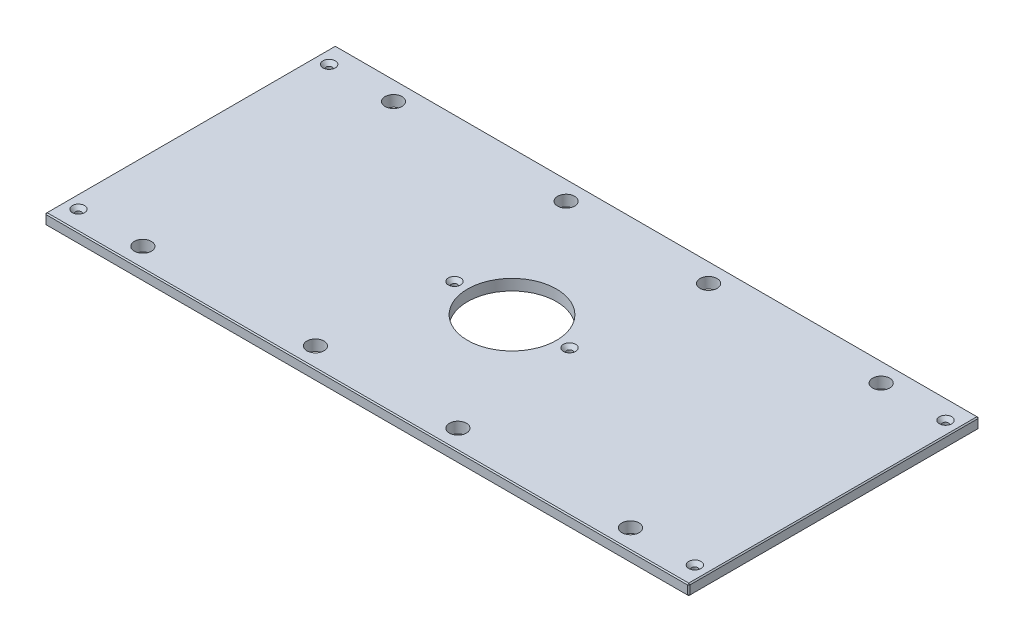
ISO-10303-21;
HEADER;
FILE_DESCRIPTION(('STEP AP214'),'2;1');
FILE_NAME('part.step','',(''),(''),'','','');
FILE_SCHEMA(('AUTOMOTIVE_DESIGN { 1 0 10303 214 1 1 1 1 }'));
ENDSEC;
DATA;
#1=APPLICATION_CONTEXT('core data for automotive mechanical design processes');
#2=APPLICATION_PROTOCOL_DEFINITION('international standard','automotive_design',2000,#1);
#3=PRODUCT_CONTEXT('',#1,'mechanical');
#4=PRODUCT('Part','Part','',(#3));
#5=PRODUCT_RELATED_PRODUCT_CATEGORY('part','',(#4));
#6=PRODUCT_DEFINITION_FORMATION('','',#4);
#7=PRODUCT_DEFINITION_CONTEXT('part definition',#1,'design');
#8=PRODUCT_DEFINITION('design','',#6,#7);
#9=PRODUCT_DEFINITION_SHAPE('','',#8);
#10=(LENGTH_UNIT() NAMED_UNIT(*) SI_UNIT(.MILLI.,.METRE.));
#11=(NAMED_UNIT(*) PLANE_ANGLE_UNIT() SI_UNIT($,.RADIAN.));
#12=(NAMED_UNIT(*) SI_UNIT($,.STERADIAN.) SOLID_ANGLE_UNIT());
#13=UNCERTAINTY_MEASURE_WITH_UNIT(LENGTH_MEASURE(1.E-05),#10,'distance_accuracy_value','');
#14=(GEOMETRIC_REPRESENTATION_CONTEXT(3) GLOBAL_UNCERTAINTY_ASSIGNED_CONTEXT((#13)) GLOBAL_UNIT_ASSIGNED_CONTEXT((#10,
#11,#12)) REPRESENTATION_CONTEXT('',''));
#15=CARTESIAN_POINT('',(0.,0.,0.));
#16=DIRECTION('',(0.,0.,1.));
#17=DIRECTION('',(1.,0.,0.));
#18=AXIS2_PLACEMENT_3D('',#15,#16,#17);
#19=CARTESIAN_POINT('',(-373.0625,12.7,-168.275));
#20=DIRECTION('',(1.,0.,0.));
#21=DIRECTION('',(0.,0.,-1.));
#22=AXIS2_PLACEMENT_3D('',#19,#20,#21);
#23=PLANE('',#22);
#24=DIRECTION('',(0.,0.,-1.));
#25=VECTOR('',#24,1.);
#26=CARTESIAN_POINT('',(-373.0625,11.43,-168.275));
#27=LINE('',#26,#25);
#28=CARTESIAN_POINT('',(-373.0625,11.43,167.005));
#29=VERTEX_POINT('',#28);
#30=CARTESIAN_POINT('',(-373.0625,11.43,-167.005));
#31=VERTEX_POINT('',#30);
#32=EDGE_CURVE('E135',#29,#31,#27,.T.);
#33=ORIENTED_EDGE('',*,*,#32,.T.);
#34=DIRECTION('',(0.,-1.,0.));
#35=VECTOR('',#34,1.);
#36=CARTESIAN_POINT('',(-373.0625,12.7,-167.005));
#37=LINE('',#36,#35);
#38=CARTESIAN_POINT('',(-373.0625,1.26999999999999,-167.005));
#39=VERTEX_POINT('',#38);
#40=EDGE_CURVE('E131',#31,#39,#37,.T.);
#41=ORIENTED_EDGE('',*,*,#40,.T.);
#42=DIRECTION('',(0.,0.,1.));
#43=VECTOR('',#42,1.);
#44=CARTESIAN_POINT('',(-373.0625,1.26999999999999,-168.275));
#45=LINE('',#44,#43);
#46=CARTESIAN_POINT('',(-373.0625,1.26999999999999,167.005));
#47=VERTEX_POINT('',#46);
#48=EDGE_CURVE('E126',#39,#47,#45,.T.);
#49=ORIENTED_EDGE('',*,*,#48,.T.);
#50=DIRECTION('',(0.,1.,0.));
#51=VECTOR('',#50,1.);
#52=CARTESIAN_POINT('',(-373.0625,12.7,167.005));
#53=LINE('',#52,#51);
#54=EDGE_CURVE('E128',#47,#29,#53,.T.);
#55=ORIENTED_EDGE('',*,*,#54,.T.);
#56=EDGE_LOOP('',(#33,#41,#49,#55));
#57=FACE_BOUND('',#56,.T.);
#58=ADVANCED_FACE('F35',(#57),#23,.F.);
#59=CARTESIAN_POINT('',(-373.0625,12.7,168.275));
#60=DIRECTION('',(0.,0.,-1.));
#61=DIRECTION('',(-1.,0.,0.));
#62=AXIS2_PLACEMENT_3D('',#59,#60,#61);
#63=PLANE('',#62);
#64=DIRECTION('',(1.,0.,0.));
#65=VECTOR('',#64,1.);
#66=CARTESIAN_POINT('',(-373.0625,1.26999999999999,168.275));
#67=LINE('',#66,#65);
#68=CARTESIAN_POINT('',(-371.7925,1.26999999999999,168.275));
#69=VERTEX_POINT('',#68);
#70=CARTESIAN_POINT('',(371.7925,1.26999999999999,168.275));
#71=VERTEX_POINT('',#70);
#72=EDGE_CURVE('E58',#69,#71,#67,.T.);
#73=ORIENTED_EDGE('',*,*,#72,.T.);
#74=DIRECTION('',(0.,1.,0.));
#75=VECTOR('',#74,1.);
#76=CARTESIAN_POINT('',(371.7925,12.7,168.275));
#77=LINE('',#76,#75);
#78=CARTESIAN_POINT('',(371.7925,11.43,168.275));
#79=VERTEX_POINT('',#78);
#80=EDGE_CURVE('E11',#71,#79,#77,.T.);
#81=ORIENTED_EDGE('',*,*,#80,.T.);
#82=DIRECTION('',(-1.,0.,0.));
#83=VECTOR('',#82,1.);
#84=CARTESIAN_POINT('',(-373.0625,11.43,168.275));
#85=LINE('',#84,#83);
#86=CARTESIAN_POINT('',(-371.7925,11.43,168.275));
#87=VERTEX_POINT('',#86);
#88=EDGE_CURVE('E44',#79,#87,#85,.T.);
#89=ORIENTED_EDGE('',*,*,#88,.T.);
#90=DIRECTION('',(0.,-1.,0.));
#91=VECTOR('',#90,1.);
#92=CARTESIAN_POINT('',(-371.7925,12.7,168.275));
#93=LINE('',#92,#91);
#94=EDGE_CURVE('E303',#87,#69,#93,.T.);
#95=ORIENTED_EDGE('',*,*,#94,.T.);
#96=EDGE_LOOP('',(#73,#81,#89,#95));
#97=FACE_BOUND('',#96,.T.);
#98=ADVANCED_FACE('F372',(#97),#63,.F.);
#99=CARTESIAN_POINT('',(373.0625,12.7,-168.275));
#100=DIRECTION('',(-1.,0.,0.));
#101=DIRECTION('',(0.,0.,1.));
#102=AXIS2_PLACEMENT_3D('',#99,#100,#101);
#103=PLANE('',#102);
#104=DIRECTION('',(0.,0.,-1.));
#105=VECTOR('',#104,1.);
#106=CARTESIAN_POINT('',(373.0625,1.26999999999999,-168.275));
#107=LINE('',#106,#105);
#108=CARTESIAN_POINT('',(373.0625,1.26999999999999,167.005));
#109=VERTEX_POINT('',#108);
#110=CARTESIAN_POINT('',(373.0625,1.26999999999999,-167.005));
#111=VERTEX_POINT('',#110);
#112=EDGE_CURVE('E298',#109,#111,#107,.T.);
#113=ORIENTED_EDGE('',*,*,#112,.T.);
#114=DIRECTION('',(0.,1.,0.));
#115=VECTOR('',#114,1.);
#116=CARTESIAN_POINT('',(373.0625,12.7,-167.005));
#117=LINE('',#116,#115);
#118=CARTESIAN_POINT('',(373.0625,11.43,-167.005));
#119=VERTEX_POINT('',#118);
#120=EDGE_CURVE('E300',#111,#119,#117,.T.);
#121=ORIENTED_EDGE('',*,*,#120,.T.);
#122=DIRECTION('',(0.,0.,1.));
#123=VECTOR('',#122,1.);
#124=CARTESIAN_POINT('',(373.0625,11.43,168.275));
#125=LINE('',#124,#123);
#126=CARTESIAN_POINT('',(373.0625,11.43,167.005));
#127=VERTEX_POINT('',#126);
#128=EDGE_CURVE('E296',#119,#127,#125,.T.);
#129=ORIENTED_EDGE('',*,*,#128,.T.);
#130=DIRECTION('',(0.,-1.,0.));
#131=VECTOR('',#130,1.);
#132=CARTESIAN_POINT('',(373.0625,12.7,167.005));
#133=LINE('',#132,#131);
#134=EDGE_CURVE('E294',#127,#109,#133,.T.);
#135=ORIENTED_EDGE('',*,*,#134,.T.);
#136=EDGE_LOOP('',(#113,#121,#129,#135));
#137=FACE_BOUND('',#136,.T.);
#138=ADVANCED_FACE('F359',(#137),#103,.F.);
#139=CARTESIAN_POINT('',(-373.0625,12.7,-168.275));
#140=DIRECTION('',(0.,0.,1.));
#141=DIRECTION('',(1.,0.,0.));
#142=AXIS2_PLACEMENT_3D('',#139,#140,#141);
#143=PLANE('',#142);
#144=DIRECTION('',(-1.,0.,0.));
#145=VECTOR('',#144,1.);
#146=CARTESIAN_POINT('',(-373.0625,1.26999999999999,-168.275));
#147=LINE('',#146,#145);
#148=CARTESIAN_POINT('',(371.7925,1.26999999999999,-168.275));
#149=VERTEX_POINT('',#148);
#150=CARTESIAN_POINT('',(-371.7925,1.26999999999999,-168.275));
#151=VERTEX_POINT('',#150);
#152=EDGE_CURVE('E270',#149,#151,#147,.T.);
#153=ORIENTED_EDGE('',*,*,#152,.T.);
#154=DIRECTION('',(0.,1.,0.));
#155=VECTOR('',#154,1.);
#156=CARTESIAN_POINT('',(-371.7925,12.7,-168.275));
#157=LINE('',#156,#155);
#158=CARTESIAN_POINT('',(-371.7925,11.43,-168.275));
#159=VERTEX_POINT('',#158);
#160=EDGE_CURVE('E274',#151,#159,#157,.T.);
#161=ORIENTED_EDGE('',*,*,#160,.T.);
#162=DIRECTION('',(1.,0.,0.));
#163=VECTOR('',#162,1.);
#164=CARTESIAN_POINT('',(373.0625,11.43,-168.275));
#165=LINE('',#164,#163);
#166=CARTESIAN_POINT('',(371.7925,11.43,-168.275));
#167=VERTEX_POINT('',#166);
#168=EDGE_CURVE('E272',#159,#167,#165,.T.);
#169=ORIENTED_EDGE('',*,*,#168,.T.);
#170=DIRECTION('',(0.,-1.,0.));
#171=VECTOR('',#170,1.);
#172=CARTESIAN_POINT('',(371.7925,12.7,-168.275));
#173=LINE('',#172,#171);
#174=EDGE_CURVE('E268',#167,#149,#173,.T.);
#175=ORIENTED_EDGE('',*,*,#174,.T.);
#176=EDGE_LOOP('',(#153,#161,#169,#175));
#177=FACE_BOUND('',#176,.T.);
#178=ADVANCED_FACE('F333',(#177),#143,.F.);
#179=CARTESIAN_POINT('',(0.,12.7,0.));
#180=DIRECTION('',(0.,1.,0.));
#181=DIRECTION('',(0.,0.,1.));
#182=AXIS2_PLACEMENT_3D('',#179,#180,#181);
#183=PLANE('',#182);
#184=CARTESIAN_POINT('',(357.1875,12.7,-145.25498));
#185=DIRECTION('',(0.,1.,0.));
#186=DIRECTION('',(0.,0.,1.));
#187=AXIS2_PLACEMENT_3D('',#184,#185,#186);
#188=CIRCLE('',#187,7.13740000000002);
#189=CARTESIAN_POINT('',(357.1875,12.7,-138.11758));
#190=VERTEX_POINT('',#189);
#191=EDGE_CURVE('E816',#190,#190,#188,.T.);
#192=ORIENTED_EDGE('',*,*,#191,.F.);
#193=EDGE_LOOP('',(#192));
#194=FACE_BOUND('',#193,.T.);
#195=CARTESIAN_POINT('',(357.1875,12.7,145.25498));
#196=DIRECTION('',(0.,1.,0.));
#197=DIRECTION('',(0.,0.,1.));
#198=AXIS2_PLACEMENT_3D('',#195,#196,#197);
#199=CIRCLE('',#198,7.13740000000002);
#200=CARTESIAN_POINT('',(357.1875,12.7,152.39238));
#201=VERTEX_POINT('',#200);
#202=EDGE_CURVE('E820',#201,#201,#199,.T.);
#203=ORIENTED_EDGE('',*,*,#202,.F.);
#204=EDGE_LOOP('',(#203));
#205=FACE_BOUND('',#204,.T.);
#206=CARTESIAN_POINT('',(-357.1875,12.7,145.25498));
#207=DIRECTION('',(0.,1.,0.));
#208=DIRECTION('',(0.,0.,1.));
#209=AXIS2_PLACEMENT_3D('',#206,#207,#208);
#210=CIRCLE('',#209,7.13740000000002);
#211=CARTESIAN_POINT('',(-357.1875,12.7,152.39238));
#212=VERTEX_POINT('',#211);
#213=EDGE_CURVE('E824',#212,#212,#210,.T.);
#214=ORIENTED_EDGE('',*,*,#213,.F.);
#215=EDGE_LOOP('',(#214));
#216=FACE_BOUND('',#215,.T.);
#217=CARTESIAN_POINT('',(-66.675,12.7,0.));
#218=DIRECTION('',(0.,1.,0.));
#219=DIRECTION('',(0.,0.,1.));
#220=AXIS2_PLACEMENT_3D('',#217,#218,#219);
#221=CIRCLE('',#220,7.1374);
#222=CARTESIAN_POINT('',(-66.675,12.7,7.1374));
#223=VERTEX_POINT('',#222);
#224=EDGE_CURVE('E828',#223,#223,#221,.T.);
#225=ORIENTED_EDGE('',*,*,#224,.F.);
#226=EDGE_LOOP('',(#225));
#227=FACE_BOUND('',#226,.T.);
#228=CARTESIAN_POINT('',(66.675,12.7,0.));
#229=DIRECTION('',(0.,1.,0.));
#230=DIRECTION('',(0.,0.,1.));
#231=AXIS2_PLACEMENT_3D('',#228,#229,#230);
#232=CIRCLE('',#231,7.1374);
#233=CARTESIAN_POINT('',(66.675,12.7,7.1374));
#234=VERTEX_POINT('',#233);
#235=EDGE_CURVE('E832',#234,#234,#232,.T.);
#236=ORIENTED_EDGE('',*,*,#235,.F.);
#237=EDGE_LOOP('',(#236));
#238=FACE_BOUND('',#237,.T.);
#239=CARTESIAN_POINT('',(-357.1875,12.7,-145.25498));
#240=DIRECTION('',(0.,1.,0.));
#241=DIRECTION('',(0.,0.,1.));
#242=AXIS2_PLACEMENT_3D('',#239,#240,#241);
#243=CIRCLE('',#242,7.13740000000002);
#244=CARTESIAN_POINT('',(-357.1875,12.7,-138.11758));
#245=VERTEX_POINT('',#244);
#246=EDGE_CURVE('E835',#245,#245,#243,.T.);
#247=ORIENTED_EDGE('',*,*,#246,.F.);
#248=EDGE_LOOP('',(#247));
#249=FACE_BOUND('',#248,.T.);
#250=DIRECTION('',(0.,0.,-1.));
#251=VECTOR('',#250,1.);
#252=CARTESIAN_POINT('',(371.7925,12.7,-168.275));
#253=LINE('',#252,#251);
#254=CARTESIAN_POINT('',(371.7925,12.7,167.005));
#255=VERTEX_POINT('',#254);
#256=CARTESIAN_POINT('',(371.7925,12.7,-167.005));
#257=VERTEX_POINT('',#256);
#258=EDGE_CURVE('E281',#255,#257,#253,.T.);
#259=ORIENTED_EDGE('',*,*,#258,.T.);
#260=DIRECTION('',(-1.,0.,0.));
#261=VECTOR('',#260,1.);
#262=CARTESIAN_POINT('',(-373.0625,12.7,-167.005));
#263=LINE('',#262,#261);
#264=CARTESIAN_POINT('',(-371.7925,12.7,-167.005));
#265=VERTEX_POINT('',#264);
#266=EDGE_CURVE('E283',#257,#265,#263,.T.);
#267=ORIENTED_EDGE('',*,*,#266,.T.);
#268=DIRECTION('',(0.,0.,1.));
#269=VECTOR('',#268,1.);
#270=CARTESIAN_POINT('',(-371.7925,12.7,168.275));
#271=LINE('',#270,#269);
#272=CARTESIAN_POINT('',(-371.7925,12.7,167.005));
#273=VERTEX_POINT('',#272);
#274=EDGE_CURVE('E279',#265,#273,#271,.T.);
#275=ORIENTED_EDGE('',*,*,#274,.T.);
#276=DIRECTION('',(1.,0.,0.));
#277=VECTOR('',#276,1.);
#278=CARTESIAN_POINT('',(373.0625,12.7,167.005));
#279=LINE('',#278,#277);
#280=EDGE_CURVE('E277',#273,#255,#279,.T.);
#281=ORIENTED_EDGE('',*,*,#280,.T.);
#282=EDGE_LOOP('',(#259,#267,#275,#281));
#283=FACE_BOUND('',#282,.T.);
#284=CARTESIAN_POINT('',(282.575,12.7,-145.25498));
#285=DIRECTION('',(0.,1.,0.));
#286=DIRECTION('',(0.,0.,1.));
#287=AXIS2_PLACEMENT_3D('',#284,#285,#286);
#288=CIRCLE('',#287,9.92187500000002);
#289=CARTESIAN_POINT('',(282.575,12.7,-135.333105));
#290=VERTEX_POINT('',#289);
#291=EDGE_CURVE('E204',#290,#290,#288,.T.);
#292=ORIENTED_EDGE('',*,*,#291,.F.);
#293=EDGE_LOOP('',(#292));
#294=FACE_BOUND('',#293,.T.);
#295=CARTESIAN_POINT('',(-282.575,12.7,-145.25498));
#296=DIRECTION('',(0.,1.,0.));
#297=DIRECTION('',(0.,0.,1.));
#298=AXIS2_PLACEMENT_3D('',#295,#296,#297);
#299=CIRCLE('',#298,9.92187500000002);
#300=CARTESIAN_POINT('',(-282.575,12.7,-135.333105));
#301=VERTEX_POINT('',#300);
#302=EDGE_CURVE('E214',#301,#301,#299,.T.);
#303=ORIENTED_EDGE('',*,*,#302,.F.);
#304=EDGE_LOOP('',(#303));
#305=FACE_BOUND('',#304,.T.);
#306=CARTESIAN_POINT('',(282.575,12.7,145.25498));
#307=DIRECTION('',(0.,1.,0.));
#308=DIRECTION('',(0.,0.,1.));
#309=AXIS2_PLACEMENT_3D('',#306,#307,#308);
#310=CIRCLE('',#309,9.92187500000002);
#311=CARTESIAN_POINT('',(282.575,12.7,155.176855));
#312=VERTEX_POINT('',#311);
#313=EDGE_CURVE('E225',#312,#312,#310,.T.);
#314=ORIENTED_EDGE('',*,*,#313,.F.);
#315=EDGE_LOOP('',(#314));
#316=FACE_BOUND('',#315,.T.);
#317=CARTESIAN_POINT('',(-282.575,12.7,145.25498));
#318=DIRECTION('',(0.,1.,0.));
#319=DIRECTION('',(0.,0.,1.));
#320=AXIS2_PLACEMENT_3D('',#317,#318,#319);
#321=CIRCLE('',#320,9.92187500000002);
#322=CARTESIAN_POINT('',(-282.575,12.7,155.176855));
#323=VERTEX_POINT('',#322);
#324=EDGE_CURVE('E231',#323,#323,#321,.T.);
#325=ORIENTED_EDGE('',*,*,#324,.F.);
#326=EDGE_LOOP('',(#325));
#327=FACE_BOUND('',#326,.T.);
#328=CARTESIAN_POINT('',(-82.55,12.7,-145.25498));
#329=DIRECTION('',(0.,1.,0.));
#330=DIRECTION('',(0.,0.,1.));
#331=AXIS2_PLACEMENT_3D('',#328,#329,#330);
#332=CIRCLE('',#331,9.921875);
#333=CARTESIAN_POINT('',(-82.55,12.7,-135.333105));
#334=VERTEX_POINT('',#333);
#335=EDGE_CURVE('E237',#334,#334,#332,.T.);
#336=ORIENTED_EDGE('',*,*,#335,.F.);
#337=EDGE_LOOP('',(#336));
#338=FACE_BOUND('',#337,.T.);
#339=CARTESIAN_POINT('',(82.55,12.7,-145.25498));
#340=DIRECTION('',(0.,1.,0.));
#341=DIRECTION('',(0.,0.,1.));
#342=AXIS2_PLACEMENT_3D('',#339,#340,#341);
#343=CIRCLE('',#342,9.921875);
#344=CARTESIAN_POINT('',(82.55,12.7,-135.333105));
#345=VERTEX_POINT('',#344);
#346=EDGE_CURVE('E243',#345,#345,#343,.T.);
#347=ORIENTED_EDGE('',*,*,#346,.F.);
#348=EDGE_LOOP('',(#347));
#349=FACE_BOUND('',#348,.T.);
#350=CARTESIAN_POINT('',(82.55,12.7,145.25498));
#351=DIRECTION('',(0.,1.,0.));
#352=DIRECTION('',(0.,0.,1.));
#353=AXIS2_PLACEMENT_3D('',#350,#351,#352);
#354=CIRCLE('',#353,9.921875);
#355=CARTESIAN_POINT('',(82.55,12.7,155.176855));
#356=VERTEX_POINT('',#355);
#357=EDGE_CURVE('E249',#356,#356,#354,.T.);
#358=ORIENTED_EDGE('',*,*,#357,.F.);
#359=EDGE_LOOP('',(#358));
#360=FACE_BOUND('',#359,.T.);
#361=CARTESIAN_POINT('',(-82.55,12.7,145.25498));
#362=DIRECTION('',(0.,1.,0.));
#363=DIRECTION('',(0.,0.,1.));
#364=AXIS2_PLACEMENT_3D('',#361,#362,#363);
#365=CIRCLE('',#364,9.921875);
#366=CARTESIAN_POINT('',(-82.55,12.7,155.176855));
#367=VERTEX_POINT('',#366);
#368=EDGE_CURVE('E255',#367,#367,#365,.T.);
#369=ORIENTED_EDGE('',*,*,#368,.F.);
#370=EDGE_LOOP('',(#369));
#371=FACE_BOUND('',#370,.T.);
#372=CARTESIAN_POINT('',(0.,12.7,0.));
#373=DIRECTION('',(0.,1.,0.));
#374=DIRECTION('',(0.,0.,1.));
#375=AXIS2_PLACEMENT_3D('',#372,#373,#374);
#376=CIRCLE('',#375,51.562);
#377=CARTESIAN_POINT('',(0.,12.7,51.562));
#378=VERTEX_POINT('',#377);
#379=EDGE_CURVE('E261',#378,#378,#376,.T.);
#380=ORIENTED_EDGE('',*,*,#379,.F.);
#381=EDGE_LOOP('',(#380));
#382=FACE_BOUND('',#381,.T.);
#383=ADVANCED_FACE('F381',(#194,#205,#216,#227,#238,#249,#283,#294,#305,#316,#327,#338,#349,
#360,#371,#382),#183,.T.);
#384=CARTESIAN_POINT('',(0.,0.,0.));
#385=DIRECTION('',(0.,1.,0.));
#386=DIRECTION('',(0.,0.,1.));
#387=AXIS2_PLACEMENT_3D('',#384,#385,#386);
#388=PLANE('',#387);
#389=CARTESIAN_POINT('',(357.1875,0.,-145.25498));
#390=DIRECTION('',(0.,1.,0.));
#391=DIRECTION('',(0.,0.,1.));
#392=AXIS2_PLACEMENT_3D('',#389,#390,#391);
#393=CIRCLE('',#392,3.3782);
#394=CARTESIAN_POINT('',(357.1875,0.,-141.87678));
#395=VERTEX_POINT('',#394);
#396=EDGE_CURVE('E869',#395,#395,#393,.T.);
#397=ORIENTED_EDGE('',*,*,#396,.T.);
#398=EDGE_LOOP('',(#397));
#399=FACE_BOUND('',#398,.T.);
#400=CARTESIAN_POINT('',(357.1875,0.,145.25498));
#401=DIRECTION('',(0.,1.,0.));
#402=DIRECTION('',(0.,0.,1.));
#403=AXIS2_PLACEMENT_3D('',#400,#401,#402);
#404=CIRCLE('',#403,3.3782);
#405=CARTESIAN_POINT('',(357.1875,0.,148.63318));
#406=VERTEX_POINT('',#405);
#407=EDGE_CURVE('E862',#406,#406,#404,.T.);
#408=ORIENTED_EDGE('',*,*,#407,.T.);
#409=EDGE_LOOP('',(#408));
#410=FACE_BOUND('',#409,.T.);
#411=CARTESIAN_POINT('',(-357.1875,0.,145.25498));
#412=DIRECTION('',(0.,1.,0.));
#413=DIRECTION('',(0.,0.,1.));
#414=AXIS2_PLACEMENT_3D('',#411,#412,#413);
#415=CIRCLE('',#414,3.3782);
#416=CARTESIAN_POINT('',(-357.1875,0.,148.63318));
#417=VERTEX_POINT('',#416);
#418=EDGE_CURVE('E855',#417,#417,#415,.T.);
#419=ORIENTED_EDGE('',*,*,#418,.T.);
#420=EDGE_LOOP('',(#419));
#421=FACE_BOUND('',#420,.T.);
#422=CARTESIAN_POINT('',(-66.675,0.,0.));
#423=DIRECTION('',(0.,1.,0.));
#424=DIRECTION('',(0.,0.,1.));
#425=AXIS2_PLACEMENT_3D('',#422,#423,#424);
#426=CIRCLE('',#425,3.3782);
#427=CARTESIAN_POINT('',(-66.675,0.,3.3782));
#428=VERTEX_POINT('',#427);
#429=EDGE_CURVE('E848',#428,#428,#426,.T.);
#430=ORIENTED_EDGE('',*,*,#429,.T.);
#431=EDGE_LOOP('',(#430));
#432=FACE_BOUND('',#431,.T.);
#433=CARTESIAN_POINT('',(66.675,0.,0.));
#434=DIRECTION('',(0.,1.,0.));
#435=DIRECTION('',(0.,0.,1.));
#436=AXIS2_PLACEMENT_3D('',#433,#434,#435);
#437=CIRCLE('',#436,3.3782);
#438=CARTESIAN_POINT('',(66.675,0.,3.3782));
#439=VERTEX_POINT('',#438);
#440=EDGE_CURVE('E838',#439,#439,#437,.T.);
#441=ORIENTED_EDGE('',*,*,#440,.T.);
#442=EDGE_LOOP('',(#441));
#443=FACE_BOUND('',#442,.T.);
#444=CARTESIAN_POINT('',(-357.1875,0.,-145.25498));
#445=DIRECTION('',(0.,1.,0.));
#446=DIRECTION('',(0.,0.,1.));
#447=AXIS2_PLACEMENT_3D('',#444,#445,#446);
#448=CIRCLE('',#447,3.3782);
#449=CARTESIAN_POINT('',(-357.1875,0.,-141.87678));
#450=VERTEX_POINT('',#449);
#451=EDGE_CURVE('E217',#450,#450,#448,.T.);
#452=ORIENTED_EDGE('',*,*,#451,.T.);
#453=EDGE_LOOP('',(#452));
#454=FACE_BOUND('',#453,.T.);
#455=DIRECTION('',(0.,0.,-1.));
#456=VECTOR('',#455,1.);
#457=CARTESIAN_POINT('',(-371.7925,0.,0.));
#458=LINE('',#457,#456);
#459=CARTESIAN_POINT('',(-371.7925,0.,167.005));
#460=VERTEX_POINT('',#459);
#461=CARTESIAN_POINT('',(-371.7925,0.,-167.005));
#462=VERTEX_POINT('',#461);
#463=EDGE_CURVE('E158',#460,#462,#458,.T.);
#464=ORIENTED_EDGE('',*,*,#463,.T.);
#465=DIRECTION('',(1.,0.,0.));
#466=VECTOR('',#465,1.);
#467=CARTESIAN_POINT('',(0.,0.,-167.005));
#468=LINE('',#467,#466);
#469=CARTESIAN_POINT('',(371.7925,0.,-167.005));
#470=VERTEX_POINT('',#469);
#471=EDGE_CURVE('E291',#462,#470,#468,.T.);
#472=ORIENTED_EDGE('',*,*,#471,.T.);
#473=DIRECTION('',(0.,0.,1.));
#474=VECTOR('',#473,1.);
#475=CARTESIAN_POINT('',(371.7925,0.,0.));
#476=LINE('',#475,#474);
#477=CARTESIAN_POINT('',(371.7925,0.,167.005));
#478=VERTEX_POINT('',#477);
#479=EDGE_CURVE('E289',#470,#478,#476,.T.);
#480=ORIENTED_EDGE('',*,*,#479,.T.);
#481=DIRECTION('',(-1.,0.,0.));
#482=VECTOR('',#481,1.);
#483=CARTESIAN_POINT('',(0.,0.,167.005));
#484=LINE('',#483,#482);
#485=EDGE_CURVE('E286',#478,#460,#484,.T.);
#486=ORIENTED_EDGE('',*,*,#485,.T.);
#487=EDGE_LOOP('',(#464,#472,#480,#486));
#488=FACE_BOUND('',#487,.T.);
#489=CARTESIAN_POINT('',(282.575,0.,-145.25498));
#490=DIRECTION('',(0.,1.,0.));
#491=DIRECTION('',(0.,0.,1.));
#492=AXIS2_PLACEMENT_3D('',#489,#490,#491);
#493=CIRCLE('',#492,9.92187500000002);
#494=CARTESIAN_POINT('',(282.575,0.,-135.333105));
#495=VERTEX_POINT('',#494);
#496=EDGE_CURVE('E209',#495,#495,#493,.T.);
#497=ORIENTED_EDGE('',*,*,#496,.T.);
#498=EDGE_LOOP('',(#497));
#499=FACE_BOUND('',#498,.T.);
#500=CARTESIAN_POINT('',(-282.575,0.,-145.25498));
#501=DIRECTION('',(0.,1.,0.));
#502=DIRECTION('',(0.,0.,1.));
#503=AXIS2_PLACEMENT_3D('',#500,#501,#502);
#504=CIRCLE('',#503,9.92187500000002);
#505=CARTESIAN_POINT('',(-282.575,0.,-135.333105));
#506=VERTEX_POINT('',#505);
#507=EDGE_CURVE('E222',#506,#506,#504,.T.);
#508=ORIENTED_EDGE('',*,*,#507,.T.);
#509=EDGE_LOOP('',(#508));
#510=FACE_BOUND('',#509,.T.);
#511=CARTESIAN_POINT('',(282.575,0.,145.25498));
#512=DIRECTION('',(0.,1.,0.));
#513=DIRECTION('',(0.,0.,1.));
#514=AXIS2_PLACEMENT_3D('',#511,#512,#513);
#515=CIRCLE('',#514,9.92187500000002);
#516=CARTESIAN_POINT('',(282.575,0.,155.176855));
#517=VERTEX_POINT('',#516);
#518=EDGE_CURVE('E228',#517,#517,#515,.T.);
#519=ORIENTED_EDGE('',*,*,#518,.T.);
#520=EDGE_LOOP('',(#519));
#521=FACE_BOUND('',#520,.T.);
#522=CARTESIAN_POINT('',(-282.575,0.,145.25498));
#523=DIRECTION('',(0.,1.,0.));
#524=DIRECTION('',(0.,0.,1.));
#525=AXIS2_PLACEMENT_3D('',#522,#523,#524);
#526=CIRCLE('',#525,9.92187500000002);
#527=CARTESIAN_POINT('',(-282.575,0.,155.176855));
#528=VERTEX_POINT('',#527);
#529=EDGE_CURVE('E234',#528,#528,#526,.T.);
#530=ORIENTED_EDGE('',*,*,#529,.T.);
#531=EDGE_LOOP('',(#530));
#532=FACE_BOUND('',#531,.T.);
#533=CARTESIAN_POINT('',(-82.55,0.,-145.25498));
#534=DIRECTION('',(0.,1.,0.));
#535=DIRECTION('',(0.,0.,1.));
#536=AXIS2_PLACEMENT_3D('',#533,#534,#535);
#537=CIRCLE('',#536,9.921875);
#538=CARTESIAN_POINT('',(-82.55,0.,-135.333105));
#539=VERTEX_POINT('',#538);
#540=EDGE_CURVE('E240',#539,#539,#537,.T.);
#541=ORIENTED_EDGE('',*,*,#540,.T.);
#542=EDGE_LOOP('',(#541));
#543=FACE_BOUND('',#542,.T.);
#544=CARTESIAN_POINT('',(82.55,0.,-145.25498));
#545=DIRECTION('',(0.,1.,0.));
#546=DIRECTION('',(0.,0.,1.));
#547=AXIS2_PLACEMENT_3D('',#544,#545,#546);
#548=CIRCLE('',#547,9.921875);
#549=CARTESIAN_POINT('',(82.55,0.,-135.333105));
#550=VERTEX_POINT('',#549);
#551=EDGE_CURVE('E246',#550,#550,#548,.T.);
#552=ORIENTED_EDGE('',*,*,#551,.T.);
#553=EDGE_LOOP('',(#552));
#554=FACE_BOUND('',#553,.T.);
#555=CARTESIAN_POINT('',(82.55,0.,145.25498));
#556=DIRECTION('',(0.,1.,0.));
#557=DIRECTION('',(0.,0.,1.));
#558=AXIS2_PLACEMENT_3D('',#555,#556,#557);
#559=CIRCLE('',#558,9.921875);
#560=CARTESIAN_POINT('',(82.55,0.,155.176855));
#561=VERTEX_POINT('',#560);
#562=EDGE_CURVE('E252',#561,#561,#559,.T.);
#563=ORIENTED_EDGE('',*,*,#562,.T.);
#564=EDGE_LOOP('',(#563));
#565=FACE_BOUND('',#564,.T.);
#566=CARTESIAN_POINT('',(-82.55,0.,145.25498));
#567=DIRECTION('',(0.,1.,0.));
#568=DIRECTION('',(0.,0.,1.));
#569=AXIS2_PLACEMENT_3D('',#566,#567,#568);
#570=CIRCLE('',#569,9.921875);
#571=CARTESIAN_POINT('',(-82.55,0.,155.176855));
#572=VERTEX_POINT('',#571);
#573=EDGE_CURVE('E258',#572,#572,#570,.T.);
#574=ORIENTED_EDGE('',*,*,#573,.T.);
#575=EDGE_LOOP('',(#574));
#576=FACE_BOUND('',#575,.T.);
#577=CARTESIAN_POINT('',(0.,0.,0.));
#578=DIRECTION('',(0.,1.,0.));
#579=DIRECTION('',(0.,0.,1.));
#580=AXIS2_PLACEMENT_3D('',#577,#578,#579);
#581=CIRCLE('',#580,51.562);
#582=CARTESIAN_POINT('',(0.,0.,51.562));
#583=VERTEX_POINT('',#582);
#584=EDGE_CURVE('E147',#583,#583,#581,.T.);
#585=ORIENTED_EDGE('',*,*,#584,.T.);
#586=EDGE_LOOP('',(#585));
#587=FACE_BOUND('',#586,.T.);
#588=ADVANCED_FACE('F346',(#399,#410,#421,#432,#443,#454,#488,#499,#510,#521,#532,#543,#554,
#565,#576,#587),#388,.F.);
#589=CARTESIAN_POINT('',(0.,0.,0.));
#590=DIRECTION('',(0.,1.,0.));
#591=DIRECTION('',(0.,0.,1.));
#592=AXIS2_PLACEMENT_3D('',#589,#590,#591);
#593=CYLINDRICAL_SURFACE('',#592,51.562);
#594=ORIENTED_EDGE('',*,*,#584,.F.);
#595=EDGE_LOOP('',(#594));
#596=FACE_BOUND('',#595,.T.);
#597=ORIENTED_EDGE('',*,*,#379,.T.);
#598=EDGE_LOOP('',(#597));
#599=FACE_BOUND('',#598,.T.);
#600=ADVANCED_FACE('F751',(#596,#599),#593,.F.);
#601=CARTESIAN_POINT('',(-82.55,12.7,145.25498));
#602=DIRECTION('',(0.,1.,0.));
#603=DIRECTION('',(0.,0.,1.));
#604=AXIS2_PLACEMENT_3D('',#601,#602,#603);
#605=CYLINDRICAL_SURFACE('',#604,9.921875);
#606=ORIENTED_EDGE('',*,*,#573,.F.);
#607=EDGE_LOOP('',(#606));
#608=FACE_BOUND('',#607,.T.);
#609=ORIENTED_EDGE('',*,*,#368,.T.);
#610=EDGE_LOOP('',(#609));
#611=FACE_BOUND('',#610,.T.);
#612=ADVANCED_FACE('F742',(#608,#611),#605,.F.);
#613=CARTESIAN_POINT('',(82.55,12.7,145.25498));
#614=DIRECTION('',(0.,1.,0.));
#615=DIRECTION('',(0.,0.,1.));
#616=AXIS2_PLACEMENT_3D('',#613,#614,#615);
#617=CYLINDRICAL_SURFACE('',#616,9.921875);
#618=ORIENTED_EDGE('',*,*,#562,.F.);
#619=EDGE_LOOP('',(#618));
#620=FACE_BOUND('',#619,.T.);
#621=ORIENTED_EDGE('',*,*,#357,.T.);
#622=EDGE_LOOP('',(#621));
#623=FACE_BOUND('',#622,.T.);
#624=ADVANCED_FACE('F733',(#620,#623),#617,.F.);
#625=CARTESIAN_POINT('',(82.55,12.7,-145.25498));
#626=DIRECTION('',(0.,1.,0.));
#627=DIRECTION('',(0.,0.,1.));
#628=AXIS2_PLACEMENT_3D('',#625,#626,#627);
#629=CYLINDRICAL_SURFACE('',#628,9.921875);
#630=ORIENTED_EDGE('',*,*,#551,.F.);
#631=EDGE_LOOP('',(#630));
#632=FACE_BOUND('',#631,.T.);
#633=ORIENTED_EDGE('',*,*,#346,.T.);
#634=EDGE_LOOP('',(#633));
#635=FACE_BOUND('',#634,.T.);
#636=ADVANCED_FACE('F724',(#632,#635),#629,.F.);
#637=CARTESIAN_POINT('',(-82.55,12.7,-145.25498));
#638=DIRECTION('',(0.,1.,0.));
#639=DIRECTION('',(0.,0.,1.));
#640=AXIS2_PLACEMENT_3D('',#637,#638,#639);
#641=CYLINDRICAL_SURFACE('',#640,9.921875);
#642=ORIENTED_EDGE('',*,*,#540,.F.);
#643=EDGE_LOOP('',(#642));
#644=FACE_BOUND('',#643,.T.);
#645=ORIENTED_EDGE('',*,*,#335,.T.);
#646=EDGE_LOOP('',(#645));
#647=FACE_BOUND('',#646,.T.);
#648=ADVANCED_FACE('F715',(#644,#647),#641,.F.);
#649=CARTESIAN_POINT('',(-282.575,12.7,145.25498));
#650=DIRECTION('',(0.,1.,0.));
#651=DIRECTION('',(0.,0.,1.));
#652=AXIS2_PLACEMENT_3D('',#649,#650,#651);
#653=CYLINDRICAL_SURFACE('',#652,9.92187500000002);
#654=ORIENTED_EDGE('',*,*,#529,.F.);
#655=EDGE_LOOP('',(#654));
#656=FACE_BOUND('',#655,.T.);
#657=ORIENTED_EDGE('',*,*,#324,.T.);
#658=EDGE_LOOP('',(#657));
#659=FACE_BOUND('',#658,.T.);
#660=ADVANCED_FACE('F706',(#656,#659),#653,.F.);
#661=CARTESIAN_POINT('',(282.575,12.7,145.25498));
#662=DIRECTION('',(0.,1.,0.));
#663=DIRECTION('',(0.,0.,1.));
#664=AXIS2_PLACEMENT_3D('',#661,#662,#663);
#665=CYLINDRICAL_SURFACE('',#664,9.92187500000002);
#666=ORIENTED_EDGE('',*,*,#518,.F.);
#667=EDGE_LOOP('',(#666));
#668=FACE_BOUND('',#667,.T.);
#669=ORIENTED_EDGE('',*,*,#313,.T.);
#670=EDGE_LOOP('',(#669));
#671=FACE_BOUND('',#670,.T.);
#672=ADVANCED_FACE('F697',(#668,#671),#665,.F.);
#673=CARTESIAN_POINT('',(-282.575,12.7,-145.25498));
#674=DIRECTION('',(0.,1.,0.));
#675=DIRECTION('',(0.,0.,1.));
#676=AXIS2_PLACEMENT_3D('',#673,#674,#675);
#677=CYLINDRICAL_SURFACE('',#676,9.92187500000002);
#678=ORIENTED_EDGE('',*,*,#507,.F.);
#679=EDGE_LOOP('',(#678));
#680=FACE_BOUND('',#679,.T.);
#681=ORIENTED_EDGE('',*,*,#302,.T.);
#682=EDGE_LOOP('',(#681));
#683=FACE_BOUND('',#682,.T.);
#684=ADVANCED_FACE('F687',(#680,#683),#677,.F.);
#685=CARTESIAN_POINT('',(282.575,12.7,-145.25498));
#686=DIRECTION('',(0.,1.,0.));
#687=DIRECTION('',(0.,0.,1.));
#688=AXIS2_PLACEMENT_3D('',#685,#686,#687);
#689=CYLINDRICAL_SURFACE('',#688,9.92187500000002);
#690=ORIENTED_EDGE('',*,*,#496,.F.);
#691=EDGE_LOOP('',(#690));
#692=FACE_BOUND('',#691,.T.);
#693=ORIENTED_EDGE('',*,*,#291,.T.);
#694=EDGE_LOOP('',(#693));
#695=FACE_BOUND('',#694,.T.);
#696=ADVANCED_FACE('F390',(#692,#695),#689,.F.);
#697=CARTESIAN_POINT('',(373.0625,12.7,167.005));
#698=DIRECTION('',(-0.707106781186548,0.,-0.707106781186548));
#699=DIRECTION('',(0.,-1.,0.));
#700=AXIS2_PLACEMENT_3D('',#697,#698,#699);
#701=PLANE('',#700);
#702=DIRECTION('',(-0.707106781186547,0.,0.707106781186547));
#703=VECTOR('',#702,1.);
#704=CARTESIAN_POINT('',(373.0625,11.43,167.005));
#705=LINE('',#704,#703);
#706=EDGE_CURVE('E39',#79,#127,#705,.F.);
#707=ORIENTED_EDGE('',*,*,#706,.F.);
#708=ORIENTED_EDGE('',*,*,#80,.F.);
#709=DIRECTION('',(0.707106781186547,0.,-0.707106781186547));
#710=VECTOR('',#709,1.);
#711=CARTESIAN_POINT('',(372.4275,1.26999999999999,167.64));
#712=LINE('',#711,#710);
#713=EDGE_CURVE('E197',#109,#71,#712,.F.);
#714=ORIENTED_EDGE('',*,*,#713,.F.);
#715=ORIENTED_EDGE('',*,*,#134,.F.);
#716=EDGE_LOOP('',(#707,#708,#714,#715));
#717=FACE_BOUND('',#716,.T.);
#718=ADVANCED_FACE('F37',(#717),#701,.F.);
#719=CARTESIAN_POINT('',(373.0625,11.43,167.005));
#720=DIRECTION('',(0.577350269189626,0.577350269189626,0.577350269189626));
#721=DIRECTION('',(0.707106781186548,0.,-0.707106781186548));
#722=AXIS2_PLACEMENT_3D('',#719,#720,#721);
#723=PLANE('',#722);
#724=DIRECTION('',(0.,-0.707106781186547,0.707106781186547));
#725=VECTOR('',#724,1.);
#726=CARTESIAN_POINT('',(371.7925,12.065,167.64));
#727=LINE('',#726,#725);
#728=EDGE_CURVE('E193',#79,#255,#727,.F.);
#729=ORIENTED_EDGE('',*,*,#728,.F.);
#730=ORIENTED_EDGE('',*,*,#706,.T.);
#731=DIRECTION('',(-0.707106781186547,0.707106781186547,0.));
#732=VECTOR('',#731,1.);
#733=CARTESIAN_POINT('',(373.0625,11.43,167.005));
#734=LINE('',#733,#732);
#735=EDGE_CURVE('E195',#255,#127,#734,.F.);
#736=ORIENTED_EDGE('',*,*,#735,.F.);
#737=EDGE_LOOP('',(#729,#730,#736));
#738=FACE_BOUND('',#737,.T.);
#739=ADVANCED_FACE('F383',(#738),#723,.T.);
#740=CARTESIAN_POINT('',(371.7925,0.,167.005));
#741=DIRECTION('',(0.577350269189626,-0.577350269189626,0.577350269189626));
#742=DIRECTION('',(0.707106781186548,0.,-0.707106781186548));
#743=AXIS2_PLACEMENT_3D('',#740,#741,#742);
#744=PLANE('',#743);
#745=DIRECTION('',(-0.707106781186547,-0.707106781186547,0.));
#746=VECTOR('',#745,1.);
#747=CARTESIAN_POINT('',(371.7925,0.,167.005));
#748=LINE('',#747,#746);
#749=EDGE_CURVE('E187',#109,#478,#748,.T.);
#750=ORIENTED_EDGE('',*,*,#749,.F.);
#751=ORIENTED_EDGE('',*,*,#713,.T.);
#752=DIRECTION('',(0.,0.707106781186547,0.707106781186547));
#753=VECTOR('',#752,1.);
#754=CARTESIAN_POINT('',(371.7925,0.,167.005));
#755=LINE('',#754,#753);
#756=EDGE_CURVE('E190',#478,#71,#755,.T.);
#757=ORIENTED_EDGE('',*,*,#756,.F.);
#758=EDGE_LOOP('',(#750,#751,#757));
#759=FACE_BOUND('',#758,.T.);
#760=ADVANCED_FACE('F352',(#759),#744,.T.);
#761=CARTESIAN_POINT('',(371.7925,12.7,0.));
#762=DIRECTION('',(0.707106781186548,0.707106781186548,0.));
#763=DIRECTION('',(0.,0.,1.));
#764=AXIS2_PLACEMENT_3D('',#761,#762,#763);
#765=PLANE('',#764);
#766=ORIENTED_EDGE('',*,*,#735,.T.);
#767=ORIENTED_EDGE('',*,*,#128,.F.);
#768=DIRECTION('',(0.707106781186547,-0.707106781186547,0.));
#769=VECTOR('',#768,1.);
#770=CARTESIAN_POINT('',(372.4275,12.065,-167.005));
#771=LINE('',#770,#769);
#772=EDGE_CURVE('E182',#257,#119,#771,.T.);
#773=ORIENTED_EDGE('',*,*,#772,.F.);
#774=ORIENTED_EDGE('',*,*,#258,.F.);
#775=EDGE_LOOP('',(#766,#767,#773,#774));
#776=FACE_BOUND('',#775,.T.);
#777=ADVANCED_FACE('F369',(#776),#765,.T.);
#778=CARTESIAN_POINT('',(0.,12.7,167.005));
#779=DIRECTION('',(0.,0.707106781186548,0.707106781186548));
#780=DIRECTION('',(-1.,0.,0.));
#781=AXIS2_PLACEMENT_3D('',#778,#779,#780);
#782=PLANE('',#781);
#783=ORIENTED_EDGE('',*,*,#728,.T.);
#784=ORIENTED_EDGE('',*,*,#280,.F.);
#785=DIRECTION('',(0.,0.707106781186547,-0.707106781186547));
#786=VECTOR('',#785,1.);
#787=CARTESIAN_POINT('',(-371.7925,12.7,167.005));
#788=LINE('',#787,#786);
#789=EDGE_CURVE('E179',#87,#273,#788,.T.);
#790=ORIENTED_EDGE('',*,*,#789,.F.);
#791=ORIENTED_EDGE('',*,*,#88,.F.);
#792=EDGE_LOOP('',(#783,#784,#790,#791));
#793=FACE_BOUND('',#792,.T.);
#794=ADVANCED_FACE('F374',(#793),#782,.T.);
#795=CARTESIAN_POINT('',(-371.7925,12.7,168.275));
#796=DIRECTION('',(0.707106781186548,0.,-0.707106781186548));
#797=DIRECTION('',(0.,-1.,0.));
#798=AXIS2_PLACEMENT_3D('',#795,#796,#797);
#799=PLANE('',#798);
#800=DIRECTION('',(0.707106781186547,0.,0.707106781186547));
#801=VECTOR('',#800,1.);
#802=CARTESIAN_POINT('',(-373.0625,1.26999999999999,167.005));
#803=LINE('',#802,#801);
#804=EDGE_CURVE('E142',#69,#47,#803,.F.);
#805=ORIENTED_EDGE('',*,*,#804,.F.);
#806=ORIENTED_EDGE('',*,*,#94,.F.);
#807=DIRECTION('',(-0.707106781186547,0.,-0.707106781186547));
#808=VECTOR('',#807,1.);
#809=CARTESIAN_POINT('',(-372.4275,11.43,167.64));
#810=LINE('',#809,#808);
#811=EDGE_CURVE('E145',#29,#87,#810,.F.);
#812=ORIENTED_EDGE('',*,*,#811,.F.);
#813=ORIENTED_EDGE('',*,*,#54,.F.);
#814=EDGE_LOOP('',(#805,#806,#812,#813));
#815=FACE_BOUND('',#814,.T.);
#816=ADVANCED_FACE('F140',(#815),#799,.F.);
#817=CARTESIAN_POINT('',(-373.0625,1.26999999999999,168.275));
#818=DIRECTION('',(0.,0.707106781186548,-0.707106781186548));
#819=DIRECTION('',(1.,0.,0.));
#820=AXIS2_PLACEMENT_3D('',#817,#818,#819);
#821=PLANE('',#820);
#822=ORIENTED_EDGE('',*,*,#756,.T.);
#823=ORIENTED_EDGE('',*,*,#72,.F.);
#824=DIRECTION('',(0.,-0.707106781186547,-0.707106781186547));
#825=VECTOR('',#824,1.);
#826=CARTESIAN_POINT('',(-371.7925,0.634999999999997,167.64));
#827=LINE('',#826,#825);
#828=EDGE_CURVE('E155',#460,#69,#827,.F.);
#829=ORIENTED_EDGE('',*,*,#828,.F.);
#830=ORIENTED_EDGE('',*,*,#485,.F.);
#831=EDGE_LOOP('',(#822,#823,#829,#830));
#832=FACE_BOUND('',#831,.T.);
#833=ADVANCED_FACE('F351',(#832),#821,.F.);
#834=CARTESIAN_POINT('',(373.0625,1.26999999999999,-168.275));
#835=DIRECTION('',(-0.707106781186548,0.707106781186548,0.));
#836=DIRECTION('',(0.,0.,-1.));
#837=AXIS2_PLACEMENT_3D('',#834,#835,#836);
#838=PLANE('',#837);
#839=ORIENTED_EDGE('',*,*,#749,.T.);
#840=ORIENTED_EDGE('',*,*,#479,.F.);
#841=DIRECTION('',(0.707106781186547,0.707106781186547,0.));
#842=VECTOR('',#841,1.);
#843=CARTESIAN_POINT('',(371.7925,0.,-167.005));
#844=LINE('',#843,#842);
#845=EDGE_CURVE('E174',#111,#470,#844,.F.);
#846=ORIENTED_EDGE('',*,*,#845,.F.);
#847=ORIENTED_EDGE('',*,*,#112,.F.);
#848=EDGE_LOOP('',(#839,#840,#846,#847));
#849=FACE_BOUND('',#848,.T.);
#850=ADVANCED_FACE('F356',(#849),#838,.F.);
#851=CARTESIAN_POINT('',(371.7925,12.7,-168.275));
#852=DIRECTION('',(-0.707106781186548,0.,0.707106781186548));
#853=DIRECTION('',(0.,-1.,0.));
#854=AXIS2_PLACEMENT_3D('',#851,#852,#853);
#855=PLANE('',#854);
#856=DIRECTION('',(0.707106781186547,0.,0.707106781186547));
#857=VECTOR('',#856,1.);
#858=CARTESIAN_POINT('',(371.7925,11.43,-168.275));
#859=LINE('',#858,#857);
#860=EDGE_CURVE('E184',#119,#167,#859,.F.);
#861=ORIENTED_EDGE('',*,*,#860,.F.);
#862=ORIENTED_EDGE('',*,*,#120,.F.);
#863=DIRECTION('',(-0.707106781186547,0.,-0.707106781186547));
#864=VECTOR('',#863,1.);
#865=CARTESIAN_POINT('',(372.4275,1.26999999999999,-167.64));
#866=LINE('',#865,#864);
#867=EDGE_CURVE('E171',#149,#111,#866,.F.);
#868=ORIENTED_EDGE('',*,*,#867,.F.);
#869=ORIENTED_EDGE('',*,*,#174,.F.);
#870=EDGE_LOOP('',(#861,#862,#868,#869));
#871=FACE_BOUND('',#870,.T.);
#872=ADVANCED_FACE('F364',(#871),#855,.F.);
#873=CARTESIAN_POINT('',(371.7925,11.43,-168.275));
#874=DIRECTION('',(0.577350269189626,0.577350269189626,-0.577350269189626));
#875=DIRECTION('',(-0.707106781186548,0.,-0.707106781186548));
#876=AXIS2_PLACEMENT_3D('',#873,#874,#875);
#877=PLANE('',#876);
#878=ORIENTED_EDGE('',*,*,#772,.T.);
#879=ORIENTED_EDGE('',*,*,#860,.T.);
#880=DIRECTION('',(0.,0.707106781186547,0.707106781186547));
#881=VECTOR('',#880,1.);
#882=CARTESIAN_POINT('',(371.7925,11.43,-168.275));
#883=LINE('',#882,#881);
#884=EDGE_CURVE('E163',#257,#167,#883,.F.);
#885=ORIENTED_EDGE('',*,*,#884,.F.);
#886=EDGE_LOOP('',(#878,#879,#885));
#887=FACE_BOUND('',#886,.T.);
#888=ADVANCED_FACE('F422',(#887),#877,.T.);
#889=CARTESIAN_POINT('',(-371.7925,12.7,167.005));
#890=DIRECTION('',(-0.577350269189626,0.577350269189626,0.577350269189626));
#891=DIRECTION('',(0.707106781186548,0.,0.707106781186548));
#892=AXIS2_PLACEMENT_3D('',#889,#890,#891);
#893=PLANE('',#892);
#894=ORIENTED_EDGE('',*,*,#811,.T.);
#895=ORIENTED_EDGE('',*,*,#789,.T.);
#896=DIRECTION('',(-0.707106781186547,-0.707106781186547,0.));
#897=VECTOR('',#896,1.);
#898=CARTESIAN_POINT('',(-371.7925,12.7,167.005));
#899=LINE('',#898,#897);
#900=EDGE_CURVE('E159',#29,#273,#899,.F.);
#901=ORIENTED_EDGE('',*,*,#900,.F.);
#902=EDGE_LOOP('',(#894,#895,#901));
#903=FACE_BOUND('',#902,.T.);
#904=ADVANCED_FACE('F376',(#903),#893,.T.);
#905=CARTESIAN_POINT('',(-373.0625,1.26999999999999,167.005));
#906=DIRECTION('',(-0.577350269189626,-0.577350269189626,0.577350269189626));
#907=DIRECTION('',(0.707106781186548,0.,0.707106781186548));
#908=AXIS2_PLACEMENT_3D('',#905,#906,#907);
#909=PLANE('',#908);
#910=ORIENTED_EDGE('',*,*,#828,.T.);
#911=ORIENTED_EDGE('',*,*,#804,.T.);
#912=DIRECTION('',(-0.707106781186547,0.707106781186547,0.));
#913=VECTOR('',#912,1.);
#914=CARTESIAN_POINT('',(-373.0625,1.26999999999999,167.005));
#915=LINE('',#914,#913);
#916=EDGE_CURVE('E152',#460,#47,#915,.T.);
#917=ORIENTED_EDGE('',*,*,#916,.F.);
#918=EDGE_LOOP('',(#910,#911,#917));
#919=FACE_BOUND('',#918,.T.);
#920=ADVANCED_FACE('F151',(#919),#909,.T.);
#921=CARTESIAN_POINT('',(371.7925,0.,-167.005));
#922=DIRECTION('',(0.577350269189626,-0.577350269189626,-0.577350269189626));
#923=DIRECTION('',(-0.707106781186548,0.,-0.707106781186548));
#924=AXIS2_PLACEMENT_3D('',#921,#922,#923);
#925=PLANE('',#924);
#926=ORIENTED_EDGE('',*,*,#867,.T.);
#927=ORIENTED_EDGE('',*,*,#845,.T.);
#928=DIRECTION('',(0.,-0.707106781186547,0.707106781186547));
#929=VECTOR('',#928,1.);
#930=CARTESIAN_POINT('',(371.7925,0.,-167.005));
#931=LINE('',#930,#929);
#932=EDGE_CURVE('E160',#149,#470,#931,.T.);
#933=ORIENTED_EDGE('',*,*,#932,.F.);
#934=EDGE_LOOP('',(#926,#927,#933));
#935=FACE_BOUND('',#934,.T.);
#936=ADVANCED_FACE('F414',(#935),#925,.T.);
#937=CARTESIAN_POINT('',(0.,12.7,-167.005));
#938=DIRECTION('',(0.,0.707106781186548,-0.707106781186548));
#939=DIRECTION('',(1.,0.,0.));
#940=AXIS2_PLACEMENT_3D('',#937,#938,#939);
#941=PLANE('',#940);
#942=ORIENTED_EDGE('',*,*,#884,.T.);
#943=ORIENTED_EDGE('',*,*,#168,.F.);
#944=DIRECTION('',(0.,-0.707106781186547,-0.707106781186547));
#945=VECTOR('',#944,1.);
#946=CARTESIAN_POINT('',(-371.7925,11.43,-168.275));
#947=LINE('',#946,#945);
#948=EDGE_CURVE('E165',#265,#159,#947,.T.);
#949=ORIENTED_EDGE('',*,*,#948,.F.);
#950=ORIENTED_EDGE('',*,*,#266,.F.);
#951=EDGE_LOOP('',(#942,#943,#949,#950));
#952=FACE_BOUND('',#951,.T.);
#953=ADVANCED_FACE('F328',(#952),#941,.T.);
#954=CARTESIAN_POINT('',(-371.7925,12.7,0.));
#955=DIRECTION('',(-0.707106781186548,0.707106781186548,0.));
#956=DIRECTION('',(0.,0.,-1.));
#957=AXIS2_PLACEMENT_3D('',#954,#955,#956);
#958=PLANE('',#957);
#959=ORIENTED_EDGE('',*,*,#900,.T.);
#960=ORIENTED_EDGE('',*,*,#274,.F.);
#961=DIRECTION('',(0.707106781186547,0.707106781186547,0.));
#962=VECTOR('',#961,1.);
#963=CARTESIAN_POINT('',(-372.4275,12.065,-167.005));
#964=LINE('',#963,#962);
#965=EDGE_CURVE('E317',#31,#265,#964,.T.);
#966=ORIENTED_EDGE('',*,*,#965,.F.);
#967=ORIENTED_EDGE('',*,*,#32,.F.);
#968=EDGE_LOOP('',(#959,#960,#966,#967));
#969=FACE_BOUND('',#968,.T.);
#970=ADVANCED_FACE('F379',(#969),#958,.T.);
#971=CARTESIAN_POINT('',(-373.0625,1.26999999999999,-168.275));
#972=DIRECTION('',(0.707106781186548,0.707106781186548,0.));
#973=DIRECTION('',(0.,0.,1.));
#974=AXIS2_PLACEMENT_3D('',#971,#972,#973);
#975=PLANE('',#974);
#976=ORIENTED_EDGE('',*,*,#916,.T.);
#977=ORIENTED_EDGE('',*,*,#48,.F.);
#978=DIRECTION('',(0.707106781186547,-0.707106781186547,0.));
#979=VECTOR('',#978,1.);
#980=CARTESIAN_POINT('',(-373.0625,1.26999999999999,-167.005));
#981=LINE('',#980,#979);
#982=EDGE_CURVE('E314',#462,#39,#981,.F.);
#983=ORIENTED_EDGE('',*,*,#982,.F.);
#984=ORIENTED_EDGE('',*,*,#463,.F.);
#985=EDGE_LOOP('',(#976,#977,#983,#984));
#986=FACE_BOUND('',#985,.T.);
#987=ADVANCED_FACE('F157',(#986),#975,.F.);
#988=CARTESIAN_POINT('',(-373.0625,1.26999999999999,-168.275));
#989=DIRECTION('',(0.,0.707106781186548,0.707106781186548));
#990=DIRECTION('',(-1.,0.,0.));
#991=AXIS2_PLACEMENT_3D('',#988,#989,#990);
#992=PLANE('',#991);
#993=ORIENTED_EDGE('',*,*,#932,.T.);
#994=ORIENTED_EDGE('',*,*,#471,.F.);
#995=DIRECTION('',(0.,0.707106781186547,-0.707106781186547));
#996=VECTOR('',#995,1.);
#997=CARTESIAN_POINT('',(-371.7925,0.634999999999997,-167.64));
#998=LINE('',#997,#996);
#999=EDGE_CURVE('E311',#151,#462,#998,.F.);
#1000=ORIENTED_EDGE('',*,*,#999,.F.);
#1001=ORIENTED_EDGE('',*,*,#152,.F.);
#1002=EDGE_LOOP('',(#993,#994,#1000,#1001));
#1003=FACE_BOUND('',#1002,.T.);
#1004=ADVANCED_FACE('F343',(#1003),#992,.F.);
#1005=CARTESIAN_POINT('',(-371.7925,11.43,-168.275));
#1006=DIRECTION('',(-0.577350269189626,0.577350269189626,-0.577350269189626));
#1007=DIRECTION('',(-0.707106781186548,0.,0.707106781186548));
#1008=AXIS2_PLACEMENT_3D('',#1005,#1006,#1007);
#1009=PLANE('',#1008);
#1010=ORIENTED_EDGE('',*,*,#965,.T.);
#1011=ORIENTED_EDGE('',*,*,#948,.T.);
#1012=DIRECTION('',(0.707106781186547,0.,-0.707106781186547));
#1013=VECTOR('',#1012,1.);
#1014=CARTESIAN_POINT('',(-371.7925,11.43,-168.275));
#1015=LINE('',#1014,#1013);
#1016=EDGE_CURVE('E309',#31,#159,#1015,.T.);
#1017=ORIENTED_EDGE('',*,*,#1016,.F.);
#1018=EDGE_LOOP('',(#1010,#1011,#1017));
#1019=FACE_BOUND('',#1018,.T.);
#1020=ADVANCED_FACE('F323',(#1019),#1009,.T.);
#1021=CARTESIAN_POINT('',(-373.0625,1.26999999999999,-167.005));
#1022=DIRECTION('',(-0.577350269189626,-0.577350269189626,-0.577350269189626));
#1023=DIRECTION('',(-0.707106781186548,0.,0.707106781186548));
#1024=AXIS2_PLACEMENT_3D('',#1021,#1022,#1023);
#1025=PLANE('',#1024);
#1026=ORIENTED_EDGE('',*,*,#999,.T.);
#1027=ORIENTED_EDGE('',*,*,#982,.T.);
#1028=DIRECTION('',(-0.707106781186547,0.,0.707106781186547));
#1029=VECTOR('',#1028,1.);
#1030=CARTESIAN_POINT('',(-373.0625,1.26999999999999,-167.005));
#1031=LINE('',#1030,#1029);
#1032=EDGE_CURVE('E307',#151,#39,#1031,.T.);
#1033=ORIENTED_EDGE('',*,*,#1032,.F.);
#1034=EDGE_LOOP('',(#1026,#1027,#1033));
#1035=FACE_BOUND('',#1034,.T.);
#1036=ADVANCED_FACE('F340',(#1035),#1025,.T.);
#1037=CARTESIAN_POINT('',(-373.0625,12.7,-167.005));
#1038=DIRECTION('',(0.707106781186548,0.,0.707106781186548));
#1039=DIRECTION('',(0.,-1.,0.));
#1040=AXIS2_PLACEMENT_3D('',#1037,#1038,#1039);
#1041=PLANE('',#1040);
#1042=ORIENTED_EDGE('',*,*,#1016,.T.);
#1043=ORIENTED_EDGE('',*,*,#160,.F.);
#1044=ORIENTED_EDGE('',*,*,#1032,.T.);
#1045=ORIENTED_EDGE('',*,*,#40,.F.);
#1046=EDGE_LOOP('',(#1042,#1043,#1044,#1045));
#1047=FACE_BOUND('',#1046,.T.);
#1048=ADVANCED_FACE('F338',(#1047),#1041,.F.);
#1049=CARTESIAN_POINT('',(-357.1875,12.7,-145.25498));
#1050=DIRECTION('',(0.,1.,0.));
#1051=DIRECTION('',(0.,0.,1.));
#1052=AXIS2_PLACEMENT_3D('',#1049,#1050,#1051);
#1053=CYLINDRICAL_SURFACE('',#1052,3.3782);
#1054=ORIENTED_EDGE('',*,*,#451,.F.);
#1055=EDGE_LOOP('',(#1054));
#1056=FACE_BOUND('',#1055,.T.);
#1057=CARTESIAN_POINT('',(-357.1875,8.37553508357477,-145.25498));
#1058=DIRECTION('',(0.,1.,0.));
#1059=DIRECTION('',(0.,0.,1.));
#1060=AXIS2_PLACEMENT_3D('',#1057,#1058,#1059);
#1061=CIRCLE('',#1060,3.3782);
#1062=CARTESIAN_POINT('',(-357.1875,8.37553508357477,-141.87678));
#1063=VERTEX_POINT('',#1062);
#1064=EDGE_CURVE('E837',#1063,#1063,#1061,.T.);
#1065=ORIENTED_EDGE('',*,*,#1064,.T.);
#1066=EDGE_LOOP('',(#1065));
#1067=FACE_BOUND('',#1066,.T.);
#1068=ADVANCED_FACE('F401',(#1056,#1067),#1053,.F.);
#1069=CARTESIAN_POINT('',(-357.1875,12.7,-145.25498));
#1070=DIRECTION('',(0.,1.,0.));
#1071=DIRECTION('',(0.,0.,1.));
#1072=AXIS2_PLACEMENT_3D('',#1069,#1070,#1071);
#1073=CONICAL_SURFACE('',#1072,7.13740000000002,0.715584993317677);
#1074=ORIENTED_EDGE('',*,*,#1064,.F.);
#1075=EDGE_LOOP('',(#1074));
#1076=FACE_BOUND('',#1075,.T.);
#1077=ORIENTED_EDGE('',*,*,#246,.T.);
#1078=EDGE_LOOP('',(#1077));
#1079=FACE_BOUND('',#1078,.T.);
#1080=ADVANCED_FACE('F511',(#1076,#1079),#1073,.F.);
#1081=CARTESIAN_POINT('',(66.675,12.7,0.));
#1082=DIRECTION('',(0.,1.,0.));
#1083=DIRECTION('',(0.,0.,1.));
#1084=AXIS2_PLACEMENT_3D('',#1081,#1082,#1083);
#1085=CYLINDRICAL_SURFACE('',#1084,3.3782);
#1086=ORIENTED_EDGE('',*,*,#440,.F.);
#1087=EDGE_LOOP('',(#1086));
#1088=FACE_BOUND('',#1087,.T.);
#1089=CARTESIAN_POINT('',(66.675,8.37553508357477,0.));
#1090=DIRECTION('',(0.,1.,0.));
#1091=DIRECTION('',(0.,0.,1.));
#1092=AXIS2_PLACEMENT_3D('',#1089,#1090,#1091);
#1093=CIRCLE('',#1092,3.3782);
#1094=CARTESIAN_POINT('',(66.675,8.37553508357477,3.3782));
#1095=VERTEX_POINT('',#1094);
#1096=EDGE_CURVE('E842',#1095,#1095,#1093,.T.);
#1097=ORIENTED_EDGE('',*,*,#1096,.T.);
#1098=EDGE_LOOP('',(#1097));
#1099=FACE_BOUND('',#1098,.T.);
#1100=ADVANCED_FACE('F520',(#1088,#1099),#1085,.F.);
#1101=CARTESIAN_POINT('',(66.675,12.7,0.));
#1102=DIRECTION('',(0.,1.,0.));
#1103=DIRECTION('',(0.,0.,1.));
#1104=AXIS2_PLACEMENT_3D('',#1101,#1102,#1103);
#1105=CONICAL_SURFACE('',#1104,7.1374,0.715584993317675);
#1106=ORIENTED_EDGE('',*,*,#1096,.F.);
#1107=EDGE_LOOP('',(#1106));
#1108=FACE_BOUND('',#1107,.T.);
#1109=ORIENTED_EDGE('',*,*,#235,.T.);
#1110=EDGE_LOOP('',(#1109));
#1111=FACE_BOUND('',#1110,.T.);
#1112=ADVANCED_FACE('F528',(#1108,#1111),#1105,.F.);
#1113=CARTESIAN_POINT('',(-66.675,12.7,0.));
#1114=DIRECTION('',(0.,1.,0.));
#1115=DIRECTION('',(0.,0.,1.));
#1116=AXIS2_PLACEMENT_3D('',#1113,#1114,#1115);
#1117=CYLINDRICAL_SURFACE('',#1116,3.3782);
#1118=ORIENTED_EDGE('',*,*,#429,.F.);
#1119=EDGE_LOOP('',(#1118));
#1120=FACE_BOUND('',#1119,.T.);
#1121=CARTESIAN_POINT('',(-66.675,8.37553508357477,0.));
#1122=DIRECTION('',(0.,1.,0.));
#1123=DIRECTION('',(0.,0.,1.));
#1124=AXIS2_PLACEMENT_3D('',#1121,#1122,#1123);
#1125=CIRCLE('',#1124,3.3782);
#1126=CARTESIAN_POINT('',(-66.675,8.37553508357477,3.3782));
#1127=VERTEX_POINT('',#1126);
#1128=EDGE_CURVE('E851',#1127,#1127,#1125,.T.);
#1129=ORIENTED_EDGE('',*,*,#1128,.T.);
#1130=EDGE_LOOP('',(#1129));
#1131=FACE_BOUND('',#1130,.T.);
#1132=ADVANCED_FACE('F536',(#1120,#1131),#1117,.F.);
#1133=CARTESIAN_POINT('',(-66.675,12.7,0.));
#1134=DIRECTION('',(0.,1.,0.));
#1135=DIRECTION('',(0.,0.,1.));
#1136=AXIS2_PLACEMENT_3D('',#1133,#1134,#1135);
#1137=CONICAL_SURFACE('',#1136,7.1374,0.715584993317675);
#1138=ORIENTED_EDGE('',*,*,#1128,.F.);
#1139=EDGE_LOOP('',(#1138));
#1140=FACE_BOUND('',#1139,.T.);
#1141=ORIENTED_EDGE('',*,*,#224,.T.);
#1142=EDGE_LOOP('',(#1141));
#1143=FACE_BOUND('',#1142,.T.);
#1144=ADVANCED_FACE('F544',(#1140,#1143),#1137,.F.);
#1145=CARTESIAN_POINT('',(-357.1875,12.7,145.25498));
#1146=DIRECTION('',(0.,1.,0.));
#1147=DIRECTION('',(0.,0.,1.));
#1148=AXIS2_PLACEMENT_3D('',#1145,#1146,#1147);
#1149=CYLINDRICAL_SURFACE('',#1148,3.3782);
#1150=ORIENTED_EDGE('',*,*,#418,.F.);
#1151=EDGE_LOOP('',(#1150));
#1152=FACE_BOUND('',#1151,.T.);
#1153=CARTESIAN_POINT('',(-357.1875,8.37553508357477,145.25498));
#1154=DIRECTION('',(0.,1.,0.));
#1155=DIRECTION('',(0.,0.,1.));
#1156=AXIS2_PLACEMENT_3D('',#1153,#1154,#1155);
#1157=CIRCLE('',#1156,3.3782);
#1158=CARTESIAN_POINT('',(-357.1875,8.37553508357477,148.63318));
#1159=VERTEX_POINT('',#1158);
#1160=EDGE_CURVE('E858',#1159,#1159,#1157,.T.);
#1161=ORIENTED_EDGE('',*,*,#1160,.T.);
#1162=EDGE_LOOP('',(#1161));
#1163=FACE_BOUND('',#1162,.T.);
#1164=ADVANCED_FACE('F552',(#1152,#1163),#1149,.F.);
#1165=CARTESIAN_POINT('',(-357.1875,12.7,145.25498));
#1166=DIRECTION('',(0.,1.,0.));
#1167=DIRECTION('',(0.,0.,1.));
#1168=AXIS2_PLACEMENT_3D('',#1165,#1166,#1167);
#1169=CONICAL_SURFACE('',#1168,7.13740000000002,0.715584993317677);
#1170=ORIENTED_EDGE('',*,*,#1160,.F.);
#1171=EDGE_LOOP('',(#1170));
#1172=FACE_BOUND('',#1171,.T.);
#1173=ORIENTED_EDGE('',*,*,#213,.T.);
#1174=EDGE_LOOP('',(#1173));
#1175=FACE_BOUND('',#1174,.T.);
#1176=ADVANCED_FACE('F560',(#1172,#1175),#1169,.F.);
#1177=CARTESIAN_POINT('',(357.1875,12.7,145.25498));
#1178=DIRECTION('',(0.,1.,0.));
#1179=DIRECTION('',(0.,0.,1.));
#1180=AXIS2_PLACEMENT_3D('',#1177,#1178,#1179);
#1181=CYLINDRICAL_SURFACE('',#1180,3.3782);
#1182=ORIENTED_EDGE('',*,*,#407,.F.);
#1183=EDGE_LOOP('',(#1182));
#1184=FACE_BOUND('',#1183,.T.);
#1185=CARTESIAN_POINT('',(357.1875,8.37553508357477,145.25498));
#1186=DIRECTION('',(0.,1.,0.));
#1187=DIRECTION('',(0.,0.,1.));
#1188=AXIS2_PLACEMENT_3D('',#1185,#1186,#1187);
#1189=CIRCLE('',#1188,3.3782);
#1190=CARTESIAN_POINT('',(357.1875,8.37553508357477,148.63318));
#1191=VERTEX_POINT('',#1190);
#1192=EDGE_CURVE('E865',#1191,#1191,#1189,.T.);
#1193=ORIENTED_EDGE('',*,*,#1192,.T.);
#1194=EDGE_LOOP('',(#1193));
#1195=FACE_BOUND('',#1194,.T.);
#1196=ADVANCED_FACE('F568',(#1184,#1195),#1181,.F.);
#1197=CARTESIAN_POINT('',(357.1875,12.7,145.25498));
#1198=DIRECTION('',(0.,1.,0.));
#1199=DIRECTION('',(0.,0.,1.));
#1200=AXIS2_PLACEMENT_3D('',#1197,#1198,#1199);
#1201=CONICAL_SURFACE('',#1200,7.13740000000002,0.715584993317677);
#1202=ORIENTED_EDGE('',*,*,#1192,.F.);
#1203=EDGE_LOOP('',(#1202));
#1204=FACE_BOUND('',#1203,.T.);
#1205=ORIENTED_EDGE('',*,*,#202,.T.);
#1206=EDGE_LOOP('',(#1205));
#1207=FACE_BOUND('',#1206,.T.);
#1208=ADVANCED_FACE('F576',(#1204,#1207),#1201,.F.);
#1209=CARTESIAN_POINT('',(357.1875,12.7,-145.25498));
#1210=DIRECTION('',(0.,1.,0.));
#1211=DIRECTION('',(0.,0.,1.));
#1212=AXIS2_PLACEMENT_3D('',#1209,#1210,#1211);
#1213=CYLINDRICAL_SURFACE('',#1212,3.3782);
#1214=ORIENTED_EDGE('',*,*,#396,.F.);
#1215=EDGE_LOOP('',(#1214));
#1216=FACE_BOUND('',#1215,.T.);
#1217=CARTESIAN_POINT('',(357.1875,8.37553508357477,-145.25498));
#1218=DIRECTION('',(0.,1.,0.));
#1219=DIRECTION('',(0.,0.,1.));
#1220=AXIS2_PLACEMENT_3D('',#1217,#1218,#1219);
#1221=CIRCLE('',#1220,3.3782);
#1222=CARTESIAN_POINT('',(357.1875,8.37553508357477,-141.87678));
#1223=VERTEX_POINT('',#1222);
#1224=EDGE_CURVE('E872',#1223,#1223,#1221,.T.);
#1225=ORIENTED_EDGE('',*,*,#1224,.T.);
#1226=EDGE_LOOP('',(#1225));
#1227=FACE_BOUND('',#1226,.T.);
#1228=ADVANCED_FACE('F584',(#1216,#1227),#1213,.F.);
#1229=CARTESIAN_POINT('',(357.1875,12.7,-145.25498));
#1230=DIRECTION('',(0.,1.,0.));
#1231=DIRECTION('',(0.,0.,1.));
#1232=AXIS2_PLACEMENT_3D('',#1229,#1230,#1231);
#1233=CONICAL_SURFACE('',#1232,7.13740000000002,0.715584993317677);
#1234=ORIENTED_EDGE('',*,*,#1224,.F.);
#1235=EDGE_LOOP('',(#1234));
#1236=FACE_BOUND('',#1235,.T.);
#1237=ORIENTED_EDGE('',*,*,#191,.T.);
#1238=EDGE_LOOP('',(#1237));
#1239=FACE_BOUND('',#1238,.T.);
#1240=ADVANCED_FACE('F592',(#1236,#1239),#1233,.F.);
#1241=CLOSED_SHELL('',(#58,#98,#138,#178,#383,#588,#600,#612,#624,#636,#648,#660,#672,#684,#696,
#718,#739,#760,#777,#794,#816,#833,#850,#872,#888,#904,#920,#936,#953,#970,#987,#1004,#1020,
#1036,#1048,#1068,#1080,#1100,#1112,#1132,#1144,#1164,#1176,#1196,#1208,#1228,#1240));
#1242=MANIFOLD_SOLID_BREP('B2',#1241);
#1243=ADVANCED_BREP_SHAPE_REPRESENTATION('',(#18,#1242),#14);
#1244=SHAPE_DEFINITION_REPRESENTATION(#9,#1243);
ENDSEC;
END-ISO-10303-21;
